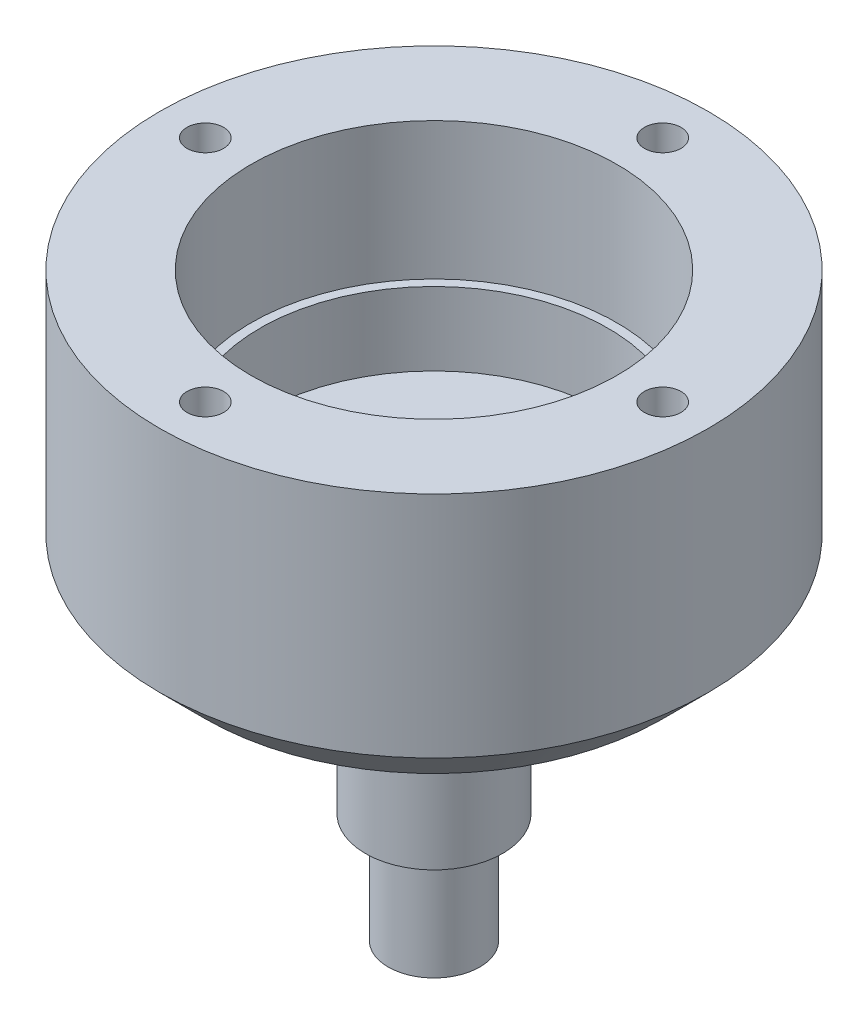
ISO-10303-21;
HEADER;
FILE_DESCRIPTION(('STEP AP214'),'2;1');
FILE_NAME('part.step','',(''),(''),'','','');
FILE_SCHEMA(('AUTOMOTIVE_DESIGN { 1 0 10303 214 1 1 1 1 }'));
ENDSEC;
DATA;
#1=APPLICATION_CONTEXT('core data for automotive mechanical design processes');
#2=APPLICATION_PROTOCOL_DEFINITION('international standard','automotive_design',2000,#1);
#3=PRODUCT_CONTEXT('',#1,'mechanical');
#4=PRODUCT('Part','Part','',(#3));
#5=PRODUCT_RELATED_PRODUCT_CATEGORY('part','',(#4));
#6=PRODUCT_DEFINITION_FORMATION('','',#4);
#7=PRODUCT_DEFINITION_CONTEXT('part definition',#1,'design');
#8=PRODUCT_DEFINITION('design','',#6,#7);
#9=PRODUCT_DEFINITION_SHAPE('','',#8);
#10=(LENGTH_UNIT() NAMED_UNIT(*) SI_UNIT(.MILLI.,.METRE.));
#11=(NAMED_UNIT(*) PLANE_ANGLE_UNIT() SI_UNIT($,.RADIAN.));
#12=(NAMED_UNIT(*) SI_UNIT($,.STERADIAN.) SOLID_ANGLE_UNIT());
#13=UNCERTAINTY_MEASURE_WITH_UNIT(LENGTH_MEASURE(1.E-05),#10,'distance_accuracy_value','');
#14=(GEOMETRIC_REPRESENTATION_CONTEXT(3) GLOBAL_UNCERTAINTY_ASSIGNED_CONTEXT((#13)) GLOBAL_UNIT_ASSIGNED_CONTEXT((#10,
#11,#12)) REPRESENTATION_CONTEXT('',''));
#15=CARTESIAN_POINT('',(0.,0.,0.));
#16=DIRECTION('',(0.,0.,1.));
#17=DIRECTION('',(1.,0.,0.));
#18=AXIS2_PLACEMENT_3D('',#15,#16,#17);
#19=CARTESIAN_POINT('',(0.,-33.5,0.));
#20=DIRECTION('',(0.,-1.,0.));
#21=DIRECTION('',(0.,0.,-1.));
#22=AXIS2_PLACEMENT_3D('',#19,#20,#21);
#23=PLANE('',#22);
#24=CARTESIAN_POINT('',(0.,-33.5,0.));
#25=DIRECTION('',(0.,1.,0.));
#26=DIRECTION('',(0.,0.,1.));
#27=AXIS2_PLACEMENT_3D('',#24,#25,#26);
#28=CIRCLE('',#27,5.);
#29=CARTESIAN_POINT('',(0.,-33.5,5.));
#30=VERTEX_POINT('',#29);
#31=EDGE_CURVE('E18',#30,#30,#28,.T.);
#32=ORIENTED_EDGE('',*,*,#31,.F.);
#33=EDGE_LOOP('',(#32));
#34=FACE_BOUND('',#33,.T.);
#35=ADVANCED_FACE('F15',(#34),#23,.T.);
#36=CARTESIAN_POINT('',(0.,-33.5,0.));
#37=DIRECTION('',(0.,1.,0.));
#38=DIRECTION('',(0.,0.,1.));
#39=AXIS2_PLACEMENT_3D('',#36,#37,#38);
#40=CYLINDRICAL_SURFACE('',#39,5.);
#41=CARTESIAN_POINT('',(0.,-21.5,0.));
#42=DIRECTION('',(0.,1.,0.));
#43=DIRECTION('',(0.,0.,1.));
#44=AXIS2_PLACEMENT_3D('',#41,#42,#43);
#45=CIRCLE('',#44,5.);
#46=CARTESIAN_POINT('',(0.,-21.5,5.));
#47=VERTEX_POINT('',#46);
#48=EDGE_CURVE('E79',#47,#47,#45,.T.);
#49=ORIENTED_EDGE('',*,*,#48,.F.);
#50=EDGE_LOOP('',(#49));
#51=FACE_BOUND('',#50,.T.);
#52=ORIENTED_EDGE('',*,*,#31,.T.);
#53=EDGE_LOOP('',(#52));
#54=FACE_BOUND('',#53,.T.);
#55=ADVANCED_FACE('F86',(#51,#54),#40,.T.);
#56=CARTESIAN_POINT('',(0.,-21.5,0.));
#57=DIRECTION('',(0.,-1.,0.));
#58=DIRECTION('',(0.,0.,-1.));
#59=AXIS2_PLACEMENT_3D('',#56,#57,#58);
#60=PLANE('',#59);
#61=ORIENTED_EDGE('',*,*,#48,.T.);
#62=EDGE_LOOP('',(#61));
#63=FACE_BOUND('',#62,.T.);
#64=CARTESIAN_POINT('',(0.,-21.5,0.));
#65=DIRECTION('',(0.,1.,0.));
#66=DIRECTION('',(0.,0.,1.));
#67=AXIS2_PLACEMENT_3D('',#64,#65,#66);
#68=CIRCLE('',#67,7.5);
#69=CARTESIAN_POINT('',(0.,-21.5,7.5));
#70=VERTEX_POINT('',#69);
#71=EDGE_CURVE('E77',#70,#70,#68,.T.);
#72=ORIENTED_EDGE('',*,*,#71,.F.);
#73=EDGE_LOOP('',(#72));
#74=FACE_BOUND('',#73,.T.);
#75=ADVANCED_FACE('F93',(#63,#74),#60,.T.);
#76=CARTESIAN_POINT('',(0.,7.,0.));
#77=DIRECTION('',(0.,1.,0.));
#78=DIRECTION('',(0.,0.,1.));
#79=AXIS2_PLACEMENT_3D('',#76,#77,#78);
#80=PLANE('',#79);
#81=CARTESIAN_POINT('',(0.,7.,0.));
#82=DIRECTION('',(0.,1.,0.));
#83=DIRECTION('',(0.,0.,1.));
#84=AXIS2_PLACEMENT_3D('',#81,#82,#83);
#85=CIRCLE('',#84,19.);
#86=CARTESIAN_POINT('',(0.,7.,19.));
#87=VERTEX_POINT('',#86);
#88=EDGE_CURVE('E74',#87,#87,#85,.T.);
#89=ORIENTED_EDGE('',*,*,#88,.T.);
#90=EDGE_LOOP('',(#89));
#91=FACE_BOUND('',#90,.T.);
#92=ADVANCED_FACE('F169',(#91),#80,.T.);
#93=CARTESIAN_POINT('',(0.,-21.5,0.));
#94=DIRECTION('',(0.,1.,0.));
#95=DIRECTION('',(0.,0.,1.));
#96=AXIS2_PLACEMENT_3D('',#93,#94,#95);
#97=CYLINDRICAL_SURFACE('',#96,7.5);
#98=CARTESIAN_POINT('',(0.,-0.5,0.));
#99=DIRECTION('',(0.,1.,0.));
#100=DIRECTION('',(0.,0.,1.));
#101=AXIS2_PLACEMENT_3D('',#98,#99,#100);
#102=CIRCLE('',#101,7.5);
#103=CARTESIAN_POINT('',(0.,-0.5,7.5));
#104=VERTEX_POINT('',#103);
#105=EDGE_CURVE('E71',#104,#104,#102,.T.);
#106=ORIENTED_EDGE('',*,*,#105,.F.);
#107=EDGE_LOOP('',(#106));
#108=FACE_BOUND('',#107,.T.);
#109=ORIENTED_EDGE('',*,*,#71,.T.);
#110=EDGE_LOOP('',(#109));
#111=FACE_BOUND('',#110,.T.);
#112=ADVANCED_FACE('F165',(#108,#111),#97,.T.);
#113=CARTESIAN_POINT('',(0.,7.,0.));
#114=DIRECTION('',(0.,1.,0.));
#115=DIRECTION('',(0.,0.,1.));
#116=AXIS2_PLACEMENT_3D('',#113,#114,#115);
#117=CYLINDRICAL_SURFACE('',#116,19.);
#118=CARTESIAN_POINT('',(0.,15.,0.));
#119=DIRECTION('',(0.,1.,0.));
#120=DIRECTION('',(0.,0.,1.));
#121=AXIS2_PLACEMENT_3D('',#118,#119,#120);
#122=CIRCLE('',#121,19.);
#123=CARTESIAN_POINT('',(0.,15.,19.));
#124=VERTEX_POINT('',#123);
#125=EDGE_CURVE('E68',#124,#124,#122,.F.);
#126=ORIENTED_EDGE('',*,*,#125,.F.);
#127=EDGE_LOOP('',(#126));
#128=FACE_BOUND('',#127,.T.);
#129=ORIENTED_EDGE('',*,*,#88,.F.);
#130=EDGE_LOOP('',(#129));
#131=FACE_BOUND('',#130,.T.);
#132=ADVANCED_FACE('F161',(#128,#131),#117,.F.);
#133=CARTESIAN_POINT('',(0.,-0.5,0.));
#134=DIRECTION('',(0.,-1.,0.));
#135=DIRECTION('',(0.,0.,-1.));
#136=AXIS2_PLACEMENT_3D('',#133,#134,#135);
#137=PLANE('',#136);
#138=ORIENTED_EDGE('',*,*,#105,.T.);
#139=EDGE_LOOP('',(#138));
#140=FACE_BOUND('',#139,.T.);
#141=CARTESIAN_POINT('',(0.,-0.5,0.));
#142=DIRECTION('',(0.,1.,0.));
#143=DIRECTION('',(0.,0.,1.));
#144=AXIS2_PLACEMENT_3D('',#141,#142,#143);
#145=CIRCLE('',#144,10.);
#146=CARTESIAN_POINT('',(0.,-0.5,10.));
#147=VERTEX_POINT('',#146);
#148=EDGE_CURVE('E65',#147,#147,#145,.T.);
#149=ORIENTED_EDGE('',*,*,#148,.F.);
#150=EDGE_LOOP('',(#149));
#151=FACE_BOUND('',#150,.T.);
#152=ADVANCED_FACE('F157',(#140,#151),#137,.T.);
#153=CARTESIAN_POINT('',(-25.,15.,-2.61861100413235E-13));
#154=DIRECTION('',(0.,1.,0.));
#155=DIRECTION('',(0.,0.,1.));
#156=AXIS2_PLACEMENT_3D('',#153,#154,#155);
#157=PLANE('',#156);
#158=CARTESIAN_POINT('',(-25.,15.,-2.61861100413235E-13));
#159=DIRECTION('',(0.,1.,0.));
#160=DIRECTION('',(0.,0.,1.));
#161=AXIS2_PLACEMENT_3D('',#158,#159,#160);
#162=CIRCLE('',#161,2.);
#163=CARTESIAN_POINT('',(-25.,15.,1.99999999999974));
#164=VERTEX_POINT('',#163);
#165=EDGE_CURVE('E62',#164,#164,#162,.T.);
#166=ORIENTED_EDGE('',*,*,#165,.T.);
#167=EDGE_LOOP('',(#166));
#168=FACE_BOUND('',#167,.T.);
#169=ADVANCED_FACE('F153',(#168),#157,.T.);
#170=CARTESIAN_POINT('',(0.,15.,25.));
#171=DIRECTION('',(0.,1.,0.));
#172=DIRECTION('',(0.,0.,1.));
#173=AXIS2_PLACEMENT_3D('',#170,#171,#172);
#174=PLANE('',#173);
#175=CARTESIAN_POINT('',(0.,15.,25.));
#176=DIRECTION('',(0.,1.,0.));
#177=DIRECTION('',(0.,0.,1.));
#178=AXIS2_PLACEMENT_3D('',#175,#176,#177);
#179=CIRCLE('',#178,2.);
#180=CARTESIAN_POINT('',(0.,15.,27.));
#181=VERTEX_POINT('',#180);
#182=EDGE_CURVE('E59',#181,#181,#179,.T.);
#183=ORIENTED_EDGE('',*,*,#182,.T.);
#184=EDGE_LOOP('',(#183));
#185=FACE_BOUND('',#184,.T.);
#186=ADVANCED_FACE('F149',(#185),#174,.T.);
#187=CARTESIAN_POINT('',(25.,15.,0.));
#188=DIRECTION('',(0.,1.,0.));
#189=DIRECTION('',(0.,0.,1.));
#190=AXIS2_PLACEMENT_3D('',#187,#188,#189);
#191=PLANE('',#190);
#192=CARTESIAN_POINT('',(25.,15.,0.));
#193=DIRECTION('',(0.,1.,0.));
#194=DIRECTION('',(0.,0.,1.));
#195=AXIS2_PLACEMENT_3D('',#192,#193,#194);
#196=CIRCLE('',#195,2.);
#197=CARTESIAN_POINT('',(25.,15.,2.00000000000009));
#198=VERTEX_POINT('',#197);
#199=EDGE_CURVE('E56',#198,#198,#196,.T.);
#200=ORIENTED_EDGE('',*,*,#199,.T.);
#201=EDGE_LOOP('',(#200));
#202=FACE_BOUND('',#201,.T.);
#203=ADVANCED_FACE('F145',(#202),#191,.T.);
#204=CARTESIAN_POINT('',(0.,15.,-25.));
#205=DIRECTION('',(0.,1.,0.));
#206=DIRECTION('',(0.,0.,1.));
#207=AXIS2_PLACEMENT_3D('',#204,#205,#206);
#208=PLANE('',#207);
#209=CARTESIAN_POINT('',(0.,15.,-25.));
#210=DIRECTION('',(0.,1.,0.));
#211=DIRECTION('',(0.,0.,1.));
#212=AXIS2_PLACEMENT_3D('',#209,#210,#211);
#213=CIRCLE('',#212,2.);
#214=CARTESIAN_POINT('',(0.,15.,-23.));
#215=VERTEX_POINT('',#214);
#216=EDGE_CURVE('E53',#215,#215,#213,.T.);
#217=ORIENTED_EDGE('',*,*,#216,.T.);
#218=EDGE_LOOP('',(#217));
#219=FACE_BOUND('',#218,.T.);
#220=ADVANCED_FACE('F141',(#219),#208,.T.);
#221=CARTESIAN_POINT('',(0.,15.,0.));
#222=DIRECTION('',(0.,1.,0.));
#223=DIRECTION('',(0.,0.,1.));
#224=AXIS2_PLACEMENT_3D('',#221,#222,#223);
#225=PLANE('',#224);
#226=CARTESIAN_POINT('',(0.,15.,0.));
#227=DIRECTION('',(0.,1.,0.));
#228=DIRECTION('',(0.,0.,1.));
#229=AXIS2_PLACEMENT_3D('',#226,#227,#228);
#230=CIRCLE('',#229,20.);
#231=CARTESIAN_POINT('',(0.,15.,20.));
#232=VERTEX_POINT('',#231);
#233=EDGE_CURVE('E50',#232,#232,#230,.T.);
#234=ORIENTED_EDGE('',*,*,#233,.T.);
#235=EDGE_LOOP('',(#234));
#236=FACE_BOUND('',#235,.T.);
#237=ORIENTED_EDGE('',*,*,#125,.T.);
#238=EDGE_LOOP('',(#237));
#239=FACE_BOUND('',#238,.T.);
#240=ADVANCED_FACE('F137',(#236,#239),#225,.T.);
#241=CARTESIAN_POINT('',(0.,-0.5,0.));
#242=DIRECTION('',(0.,1.,0.));
#243=DIRECTION('',(0.,0.,1.));
#244=AXIS2_PLACEMENT_3D('',#241,#242,#243);
#245=CYLINDRICAL_SURFACE('',#244,10.);
#246=ORIENTED_EDGE('',*,*,#148,.T.);
#247=EDGE_LOOP('',(#246));
#248=FACE_BOUND('',#247,.T.);
#249=CARTESIAN_POINT('',(0.,0.,0.));
#250=DIRECTION('',(0.,1.,0.));
#251=DIRECTION('',(0.,0.,1.));
#252=AXIS2_PLACEMENT_3D('',#249,#250,#251);
#253=CIRCLE('',#252,10.);
#254=CARTESIAN_POINT('',(0.,0.,10.));
#255=VERTEX_POINT('',#254);
#256=EDGE_CURVE('E47',#255,#255,#253,.F.);
#257=ORIENTED_EDGE('',*,*,#256,.T.);
#258=EDGE_LOOP('',(#257));
#259=FACE_BOUND('',#258,.T.);
#260=ADVANCED_FACE('F133',(#248,#259),#245,.T.);
#261=CARTESIAN_POINT('',(-25.,15.,-2.61861100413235E-13));
#262=DIRECTION('',(0.,1.,0.));
#263=DIRECTION('',(0.,0.,1.));
#264=AXIS2_PLACEMENT_3D('',#261,#262,#263);
#265=CYLINDRICAL_SURFACE('',#264,2.);
#266=CARTESIAN_POINT('',(-25.,30.,-2.61861100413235E-13));
#267=DIRECTION('',(0.,1.,0.));
#268=DIRECTION('',(0.,0.,1.));
#269=AXIS2_PLACEMENT_3D('',#266,#267,#268);
#270=CIRCLE('',#269,2.);
#271=CARTESIAN_POINT('',(-25.,30.,1.99999999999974));
#272=VERTEX_POINT('',#271);
#273=EDGE_CURVE('E44',#272,#272,#270,.F.);
#274=ORIENTED_EDGE('',*,*,#273,.F.);
#275=EDGE_LOOP('',(#274));
#276=FACE_BOUND('',#275,.T.);
#277=ORIENTED_EDGE('',*,*,#165,.F.);
#278=EDGE_LOOP('',(#277));
#279=FACE_BOUND('',#278,.T.);
#280=ADVANCED_FACE('F129',(#276,#279),#265,.F.);
#281=CARTESIAN_POINT('',(0.,15.,25.));
#282=DIRECTION('',(0.,1.,0.));
#283=DIRECTION('',(0.,0.,1.));
#284=AXIS2_PLACEMENT_3D('',#281,#282,#283);
#285=CYLINDRICAL_SURFACE('',#284,2.);
#286=CARTESIAN_POINT('',(0.,30.,25.));
#287=DIRECTION('',(0.,1.,0.));
#288=DIRECTION('',(0.,0.,1.));
#289=AXIS2_PLACEMENT_3D('',#286,#287,#288);
#290=CIRCLE('',#289,2.);
#291=CARTESIAN_POINT('',(0.,30.,27.));
#292=VERTEX_POINT('',#291);
#293=EDGE_CURVE('E41',#292,#292,#290,.F.);
#294=ORIENTED_EDGE('',*,*,#293,.F.);
#295=EDGE_LOOP('',(#294));
#296=FACE_BOUND('',#295,.T.);
#297=ORIENTED_EDGE('',*,*,#182,.F.);
#298=EDGE_LOOP('',(#297));
#299=FACE_BOUND('',#298,.T.);
#300=ADVANCED_FACE('F125',(#296,#299),#285,.F.);
#301=CARTESIAN_POINT('',(25.,15.,0.));
#302=DIRECTION('',(0.,1.,0.));
#303=DIRECTION('',(0.,0.,1.));
#304=AXIS2_PLACEMENT_3D('',#301,#302,#303);
#305=CYLINDRICAL_SURFACE('',#304,2.);
#306=CARTESIAN_POINT('',(25.,30.,0.));
#307=DIRECTION('',(0.,1.,0.));
#308=DIRECTION('',(0.,0.,1.));
#309=AXIS2_PLACEMENT_3D('',#306,#307,#308);
#310=CIRCLE('',#309,2.);
#311=CARTESIAN_POINT('',(25.,30.,2.00000000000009));
#312=VERTEX_POINT('',#311);
#313=EDGE_CURVE('E38',#312,#312,#310,.F.);
#314=ORIENTED_EDGE('',*,*,#313,.F.);
#315=EDGE_LOOP('',(#314));
#316=FACE_BOUND('',#315,.T.);
#317=ORIENTED_EDGE('',*,*,#199,.F.);
#318=EDGE_LOOP('',(#317));
#319=FACE_BOUND('',#318,.T.);
#320=ADVANCED_FACE('F121',(#316,#319),#305,.F.);
#321=CARTESIAN_POINT('',(0.,15.,-25.));
#322=DIRECTION('',(0.,1.,0.));
#323=DIRECTION('',(0.,0.,1.));
#324=AXIS2_PLACEMENT_3D('',#321,#322,#323);
#325=CYLINDRICAL_SURFACE('',#324,2.);
#326=CARTESIAN_POINT('',(0.,30.,-25.));
#327=DIRECTION('',(0.,1.,0.));
#328=DIRECTION('',(0.,0.,1.));
#329=AXIS2_PLACEMENT_3D('',#326,#327,#328);
#330=CIRCLE('',#329,2.);
#331=CARTESIAN_POINT('',(0.,30.,-23.));
#332=VERTEX_POINT('',#331);
#333=EDGE_CURVE('E35',#332,#332,#330,.F.);
#334=ORIENTED_EDGE('',*,*,#333,.F.);
#335=EDGE_LOOP('',(#334));
#336=FACE_BOUND('',#335,.T.);
#337=ORIENTED_EDGE('',*,*,#216,.F.);
#338=EDGE_LOOP('',(#337));
#339=FACE_BOUND('',#338,.T.);
#340=ADVANCED_FACE('F117',(#336,#339),#325,.F.);
#341=CARTESIAN_POINT('',(0.,15.,0.));
#342=DIRECTION('',(0.,1.,0.));
#343=DIRECTION('',(0.,0.,1.));
#344=AXIS2_PLACEMENT_3D('',#341,#342,#343);
#345=CYLINDRICAL_SURFACE('',#344,20.);
#346=CARTESIAN_POINT('',(0.,30.,0.));
#347=DIRECTION('',(0.,1.,0.));
#348=DIRECTION('',(0.,0.,1.));
#349=AXIS2_PLACEMENT_3D('',#346,#347,#348);
#350=CIRCLE('',#349,20.);
#351=CARTESIAN_POINT('',(0.,30.,20.));
#352=VERTEX_POINT('',#351);
#353=EDGE_CURVE('E32',#352,#352,#350,.F.);
#354=ORIENTED_EDGE('',*,*,#353,.F.);
#355=EDGE_LOOP('',(#354));
#356=FACE_BOUND('',#355,.T.);
#357=ORIENTED_EDGE('',*,*,#233,.F.);
#358=EDGE_LOOP('',(#357));
#359=FACE_BOUND('',#358,.T.);
#360=ADVANCED_FACE('F113',(#356,#359),#345,.F.);
#361=CARTESIAN_POINT('',(0.,0.,0.));
#362=DIRECTION('',(0.,1.,0.));
#363=DIRECTION('',(0.,0.,1.));
#364=AXIS2_PLACEMENT_3D('',#361,#362,#363);
#365=PLANE('',#364);
#366=ORIENTED_EDGE('',*,*,#256,.F.);
#367=EDGE_LOOP('',(#366));
#368=FACE_BOUND('',#367,.T.);
#369=CARTESIAN_POINT('',(0.,0.,0.));
#370=DIRECTION('',(0.,1.,0.));
#371=DIRECTION('',(0.,0.,1.));
#372=AXIS2_PLACEMENT_3D('',#369,#370,#371);
#373=CIRCLE('',#372,25.);
#374=CARTESIAN_POINT('',(0.,0.,25.));
#375=VERTEX_POINT('',#374);
#376=EDGE_CURVE('E27',#375,#375,#373,.T.);
#377=ORIENTED_EDGE('',*,*,#376,.F.);
#378=EDGE_LOOP('',(#377));
#379=FACE_BOUND('',#378,.T.);
#380=ADVANCED_FACE('F109',(#368,#379),#365,.F.);
#381=CARTESIAN_POINT('',(0.,30.,0.));
#382=DIRECTION('',(0.,1.,0.));
#383=DIRECTION('',(0.,0.,1.));
#384=AXIS2_PLACEMENT_3D('',#381,#382,#383);
#385=PLANE('',#384);
#386=CARTESIAN_POINT('',(0.,30.,0.));
#387=DIRECTION('',(0.,-1.,0.));
#388=DIRECTION('',(0.,0.,-1.));
#389=AXIS2_PLACEMENT_3D('',#386,#387,#388);
#390=CIRCLE('',#389,30.);
#391=CARTESIAN_POINT('',(0.,30.,-30.));
#392=VERTEX_POINT('',#391);
#393=EDGE_CURVE('E22',#392,#392,#390,.T.);
#394=ORIENTED_EDGE('',*,*,#393,.F.);
#395=EDGE_LOOP('',(#394));
#396=FACE_BOUND('',#395,.T.);
#397=ORIENTED_EDGE('',*,*,#353,.T.);
#398=EDGE_LOOP('',(#397));
#399=FACE_BOUND('',#398,.T.);
#400=ORIENTED_EDGE('',*,*,#333,.T.);
#401=EDGE_LOOP('',(#400));
#402=FACE_BOUND('',#401,.T.);
#403=ORIENTED_EDGE('',*,*,#313,.T.);
#404=EDGE_LOOP('',(#403));
#405=FACE_BOUND('',#404,.T.);
#406=ORIENTED_EDGE('',*,*,#293,.T.);
#407=EDGE_LOOP('',(#406));
#408=FACE_BOUND('',#407,.T.);
#409=ORIENTED_EDGE('',*,*,#273,.T.);
#410=EDGE_LOOP('',(#409));
#411=FACE_BOUND('',#410,.T.);
#412=ADVANCED_FACE('F102',(#396,#399,#402,#405,#408,#411),#385,.T.);
#413=CARTESIAN_POINT('',(0.,5.,0.));
#414=DIRECTION('',(0.,1.,0.));
#415=DIRECTION('',(0.,0.,1.));
#416=AXIS2_PLACEMENT_3D('',#413,#414,#415);
#417=CONICAL_SURFACE('',#416,30.,0.785398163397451);
#418=CARTESIAN_POINT('',(0.,5.,0.));
#419=DIRECTION('',(0.,-1.,0.));
#420=DIRECTION('',(0.,0.,-1.));
#421=AXIS2_PLACEMENT_3D('',#418,#419,#420);
#422=CIRCLE('',#421,30.);
#423=CARTESIAN_POINT('',(0.,5.,-30.));
#424=VERTEX_POINT('',#423);
#425=EDGE_CURVE('E10',#424,#424,#422,.F.);
#426=ORIENTED_EDGE('',*,*,#425,.F.);
#427=EDGE_LOOP('',(#426));
#428=FACE_BOUND('',#427,.T.);
#429=ORIENTED_EDGE('',*,*,#376,.T.);
#430=EDGE_LOOP('',(#429));
#431=FACE_BOUND('',#430,.T.);
#432=ADVANCED_FACE('F97',(#428,#431),#417,.T.);
#433=CARTESIAN_POINT('',(0.,30.,0.));
#434=DIRECTION('',(0.,-1.,0.));
#435=DIRECTION('',(0.,0.,-1.));
#436=AXIS2_PLACEMENT_3D('',#433,#434,#435);
#437=CYLINDRICAL_SURFACE('',#436,30.);
#438=ORIENTED_EDGE('',*,*,#425,.T.);
#439=EDGE_LOOP('',(#438));
#440=FACE_BOUND('',#439,.T.);
#441=ORIENTED_EDGE('',*,*,#393,.T.);
#442=EDGE_LOOP('',(#441));
#443=FACE_BOUND('',#442,.T.);
#444=ADVANCED_FACE('F95',(#440,#443),#437,.T.);
#445=CLOSED_SHELL('',(#35,#55,#75,#92,#112,#132,#152,#169,#186,#203,#220,#240,#260,#280,#300,
#320,#340,#360,#380,#412,#432,#444));
#446=MANIFOLD_SOLID_BREP('B1',#445);
#447=ADVANCED_BREP_SHAPE_REPRESENTATION('',(#18,#446),#14);
#448=SHAPE_DEFINITION_REPRESENTATION(#9,#447);
ENDSEC;
END-ISO-10303-21;
